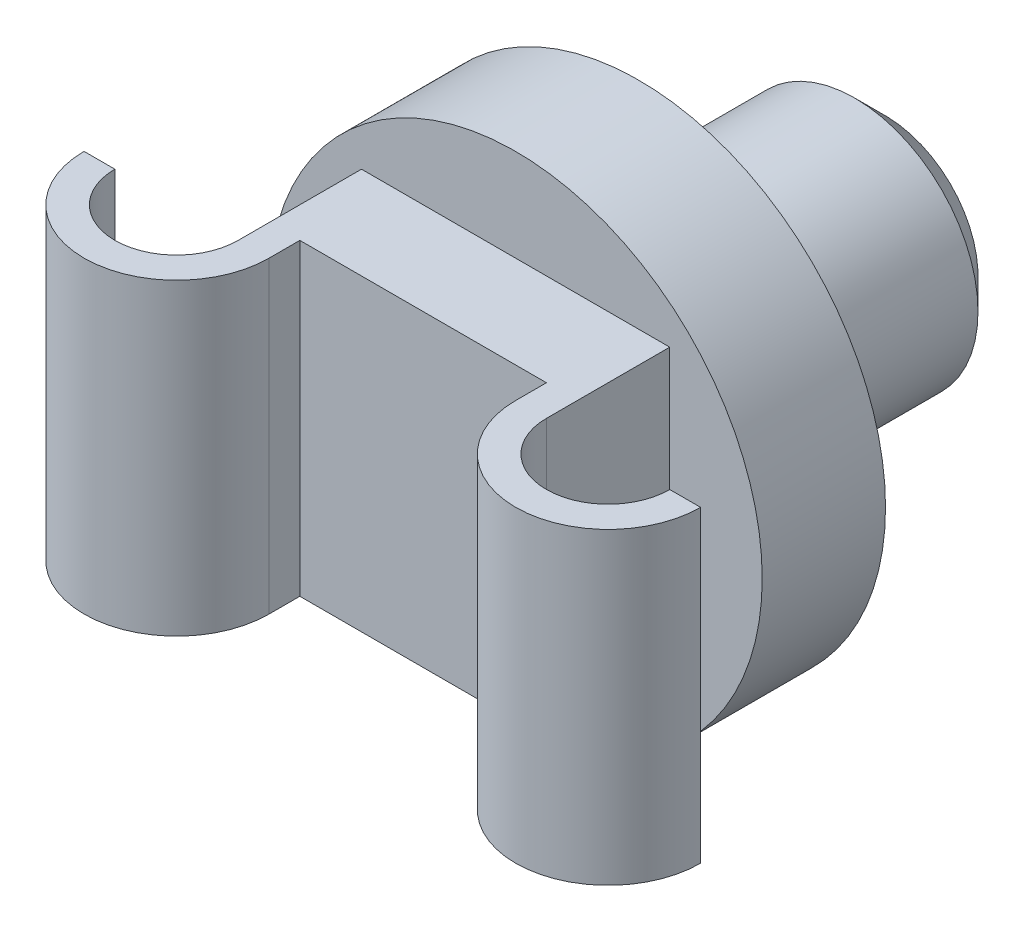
from build123d import *

# Parameters (mm, degrees)
ESQUISSE1_R             = 4
EXTRUSION1_DEPTH        = 2
ESQUISSE2_W             = 5
ESQUISSE2_H             = 5
EXTRUSION2_DEPTH        = 2
ESQUISSE5_W             = 4
ESQUISSE5_H             = 0.700036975
ENL_V_MAT_EXTRU_1_DEPTH = 9.61684397
EXTRUSION3_DEPTH        = 5
ESQUISSE7_R             = 2
EXTRUSION4_DEPTH        = 4
CHANFREIN1_SIZE         = 0.5


with BuildPart() as part:
    # Esquisse1 → Extrusion1 (new body)
    with BuildSketch(Plane.XY):
        Circle(ESQUISSE1_R)
    extrude(amount=EXTRUSION1_DEPTH)

    # Esquisse2 → Extrusion2 (add)
    with BuildSketch(Plane.XY.offset(2)):
        Rectangle(ESQUISSE2_W, ESQUISSE2_H)
    extrude(amount=EXTRUSION2_DEPTH)

    # Esquisse5 → Enl_v. mat.-Extru.1 (cut, through all)
    with BuildSketch(Plane.XZ.offset(2.5)):
        with Locations((0, 3.850018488)):
            Rectangle(ESQUISSE5_W, ESQUISSE5_H)
    extrude(amount=-ENL_V_MAT_EXTRU_1_DEPTH, mode=Mode.SUBTRACT)

    # Esquisse6 → Extrusion3 (add)
    with BuildSketch(Plane.XZ.offset(2.5)):
        with BuildLine():
            Line((2, 4), (2.5, 4))
            ThreePointArc((2.5, 4), (3.5, 5), (4.5, 4))
            Line((4.5, 4), (5, 4))
            ThreePointArc((5, 4), (3.5, 5.5), (2, 4))
        make_face()
    extrusion3 = extrude(amount=-EXTRUSION3_DEPTH)

    # Sym_trie1: Extrusion3 across plane
    add(extrusion3.mirror(Plane(origin=(0, 0, 0), x_dir=(0, 0, 1), z_dir=(1, 0, 0))))

    # Esquisse7 → Extrusion4 (add)
    with BuildSketch(Plane(origin=(0, 0, 0), x_dir=(-1, 0, 0), z_dir=(0, 0, -1))):
        with Locations(Location((0, 0, 0), (0, 0, 180))):
            Circle(ESQUISSE7_R)
    extrude(amount=EXTRUSION4_DEPTH)

    # Chanfrein1
    chanfrein1_edges = [part.edges().sort_by_distance(p)[0] for p in [
        (-2, 0, -4),
    ]]
    chamfer(chanfrein1_edges, length=CHANFREIN1_SIZE)


solid = part.part
